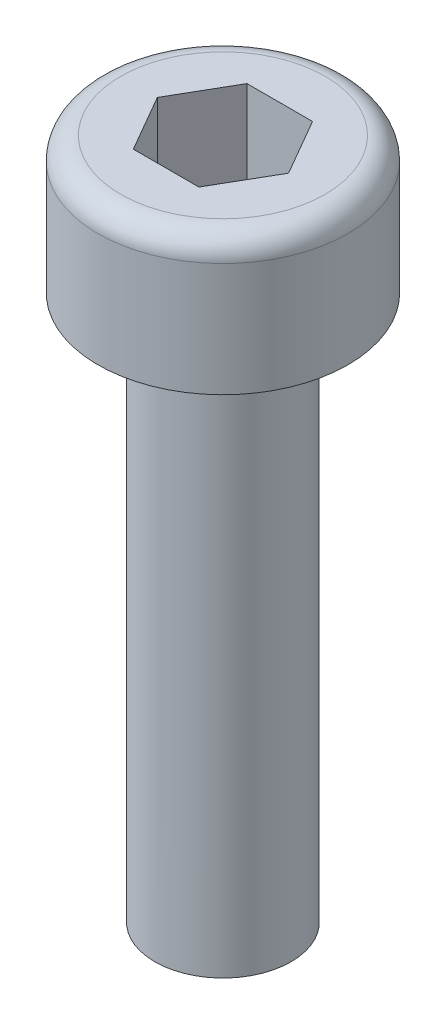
from build123d import *

# Parameters (mm, degrees)
CUT_EXTRUDE1_DEPTH = 2


with BuildPart() as part:
    # Sketch1 → Base-Revolve (revolve)
    with BuildSketch(Plane.XY):
        with BuildLine():
            Line((0, -12.401923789), (0, 3))
            Line((0, 3), (2.25, 3))
            ThreePointArc((2.25, 3), (2.603553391, 2.853553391), (2.75, 2.5))
            Line((2.75, 2.5), (2.75, 0))
            Line((2.75, 0), (1.5, 0))
            Line((1.5, 0), (1.5, -12))
            Line((1.5, -12), (0, -12.401923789))
        make_face()
    revolve(axis=Axis((0, 3, 0), (0, 1, 0)))

    # Sketch2 → Cut-Extrude1 (cut)
    with BuildSketch(Plane(origin=(0, 3, 0), x_dir=(-1, 0, 0), z_dir=(0, 1, 0))):
        Polygon((-1.443375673, 0), (-0.721687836, -1.25), (0.721687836, -1.25), (1.443375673, 0), (0.721687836, 1.25), (-0.721687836, 1.25), align=None)
    extrude(amount=-CUT_EXTRUDE1_DEPTH, mode=Mode.SUBTRACT)


solid = part.part
